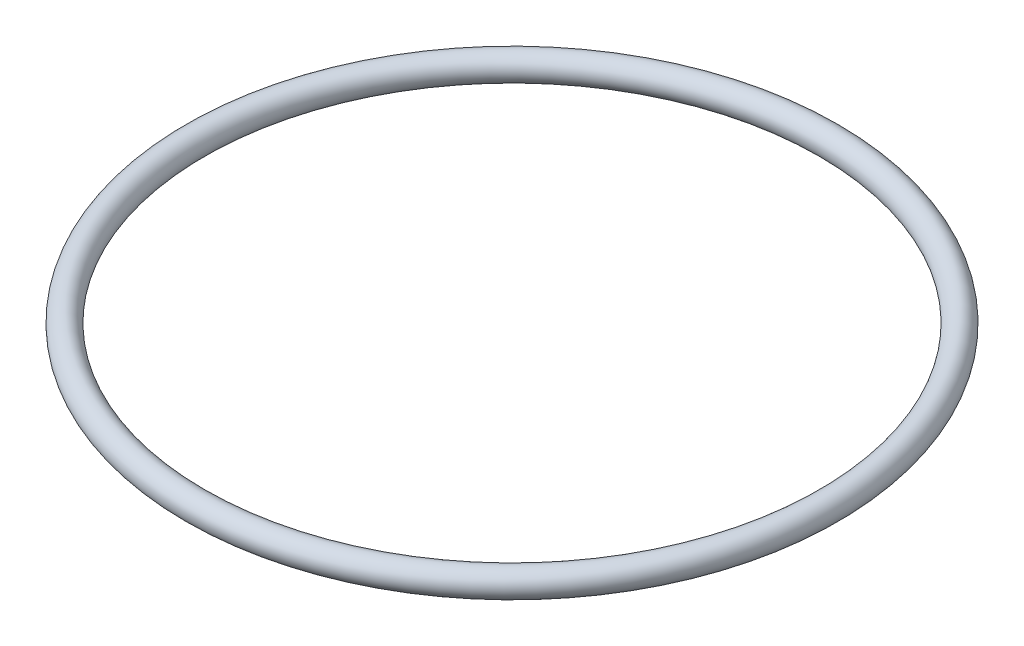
from build123d import *

# Parameters (mm, degrees)
ESQUISSE1_R = 2.665


with BuildPart() as part:
    # Esquisse1 → Base-R_volution (revolve)
    with BuildSketch(Plane.XY, mode=Mode.PRIVATE) as base_r_volution_sk:
        with Locations((-64.565, 2.665)):
            Circle(ESQUISSE1_R)
    revolve(base_r_volution_sk.sketch.rotate(Axis((0, 0, 0), (0, 1, 0)), 270), axis=Axis((0, 0, 0), (0, 1, 0)))


solid = part.part
